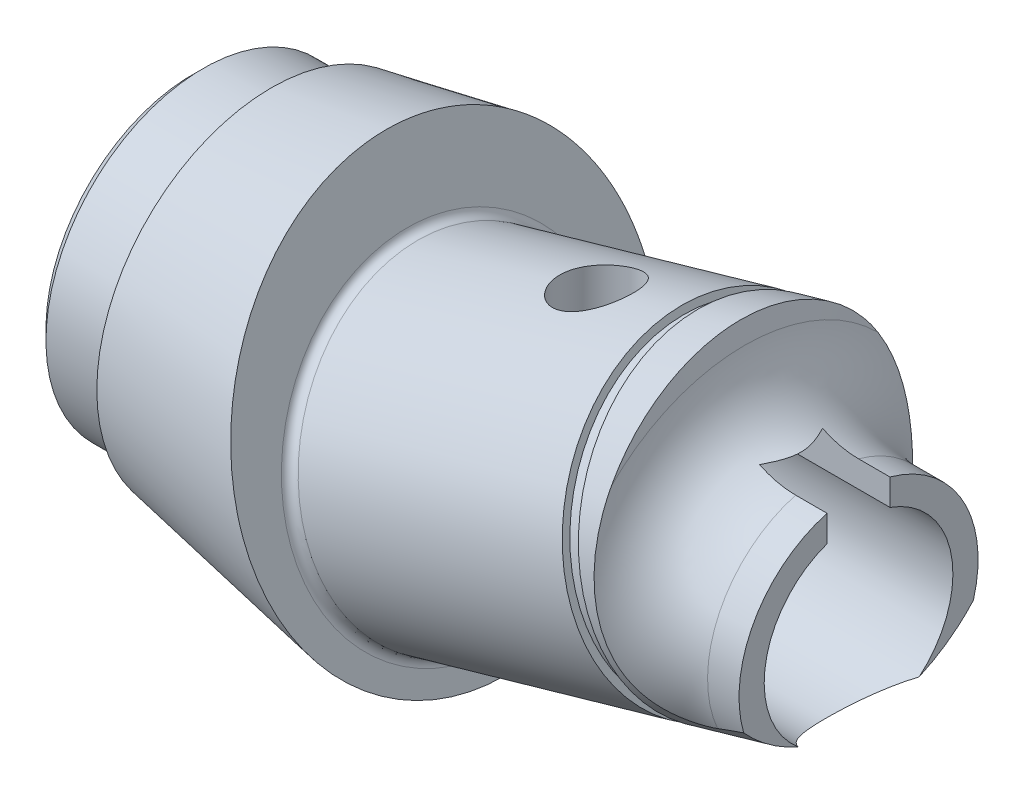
from build123d import *

# Parameters (mm, degrees)
ESQUISSE4_R                  = 9
ENL_V_MAT_EXTRU_1_DEPTH      = 70.657374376
CONG_2_R                     = 0.8
CHANFREIN1_SIZE              = 1
ESQUISSE11_R                 = 11
VIDEMENT_DEPTH               = 10
ESQUISSE13_R                 = 3.5
ENL_V_MAT_EXTRU_9_DEPTH      = 70.657374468
ENL_V_MAT_EXTRU_8_REACH      = 71.657
ENL_V_MAT_EXTRU_8_END_RADIUS = 3.5
ESQUISSE12_W                 = 6
ESQUISSE12_H                 = 11.8


with BuildPart() as part:
    # Esquisse1 → Base-R_volution (revolve)
    with BuildSketch(Plane.XY):
        with BuildLine():
            Line((0, 0), (0, 15))
            Line((0, 15), (7.5, 15))
            Line((7.5, 15), (7.5, 16.65))
            Line((7.5, 16.65), (51.366597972, 24.780193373))
            Line((51.366597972, 24.780193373), (52.633960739, 17.942115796))
            ThreePointArc((52.633960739, 17.942115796), (55.384487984, 13.249265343), (60.5, 11.4))
            Line((60.5, 11.4), (63.5, 11.4))
            Line((63.5, 11.4), (63.5, 0))
            Line((63.5, 0), (0, 0))
        make_face()
    revolve(axis=Axis((101.964912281, 0, 0), (-1, 0, 0)))

    # Esquisse3 → Enl_vement de mati_re-R_volution1 (revolve, cut)
    with BuildSketch(Plane.XY):
        Polygon((20.709037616, 10.835639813), (46.663103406, 18.277848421), (46.856049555, 17.604965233), (48.394068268, 18.045985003), (48.201122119, 18.71886819), (68.772122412, 24.617507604), (62.708100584, 45.765264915), (14.645015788, 31.983397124), align=None)
    revolve(axis=Axis((54.956008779, 5.051309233, 0), (-0.9612616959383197, -0.2756373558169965, 0)), mode=Mode.SUBTRACT)

    # Esquisse4 → Enl_v. mat.-Extru.1 (cut, through all)
    with BuildSketch(Plane(origin=(63.5, 0, 0), x_dir=(0, 0, -1), z_dir=(1, 0, 0))):
        with Locations(Location((0, 0, 0), (0, 0, 90))):
            Circle(ESQUISSE4_R)
    extrude(amount=-ENL_V_MAT_EXTRU_1_DEPTH, mode=Mode.SUBTRACT)

    # Cong_2
    cong_2_edges = [part.edges().sort_by_distance(p)[0] for p in [
        (28.97815829, -18.002211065, 0),
        (7.5, -15, 0),
    ]]
    fillet(cong_2_edges, radius=CONG_2_R)

    # Chanfrein1
    chanfrein1_edges = [part.edges().sort_by_distance(p)[0] for p in [
        (0, -15, 0),
    ]]
    chamfer(chanfrein1_edges, length=CHANFREIN1_SIZE)

    # Esquisse11 → videment (cut)
    with BuildSketch(Plane.ZY):
        with Locations(Location((0, 0, 0), (0, 0, 270))):
            Circle(ESQUISSE11_R)
    extrude(amount=-VIDEMENT_DEPTH, mode=Mode.SUBTRACT)

    # Esquisse13 → Enl_v. mat.-Extru.9 (cut, through all)
    with BuildSketch(Plane(origin=(0, 0, 0), x_dir=(1, 0, 0), z_dir=(0, 1, 0))):
        with Locations(Location((38.5, 0, 0), (0, 0, 180))):
            Circle(ESQUISSE13_R)
    extrude(amount=ENL_V_MAT_EXTRU_9_DEPTH, mode=Mode.SUBTRACT)

    # Enl_v. mat.-Extru.8: up to this cylinder (the profile starts outside it)
    enl_v_mat_extru_8_end = Plane(origin=(38.5, 5.9, 0), z_dir=(0, -1, 0)) * Cylinder(ENL_V_MAT_EXTRU_8_END_RADIUS, 151.314, mode=Mode.PRIVATE)
    # Esquisse12 → Enl_v. mat.-Extru.8 (cut, up to the surface)
    with BuildSketch(Plane(origin=(63.5, 0, 0), x_dir=(0, 0, -1), z_dir=(1, 0, 0)), mode=Mode.PRIVATE) as enl_v_mat_extru_8_sk1:
        with Locations((0, 5.9)):
            Rectangle(ESQUISSE12_W, ESQUISSE12_H)
    enl_v_mat_extru_8_tool1 = extrude(enl_v_mat_extru_8_sk1.sketch, amount=-ENL_V_MAT_EXTRU_8_REACH, mode=Mode.PRIVATE) - enl_v_mat_extru_8_end
    add(enl_v_mat_extru_8_tool1.solids().sort_by_distance((63.5, 5.9, 0))[0], mode=Mode.SUBTRACT)


solid = part.part
